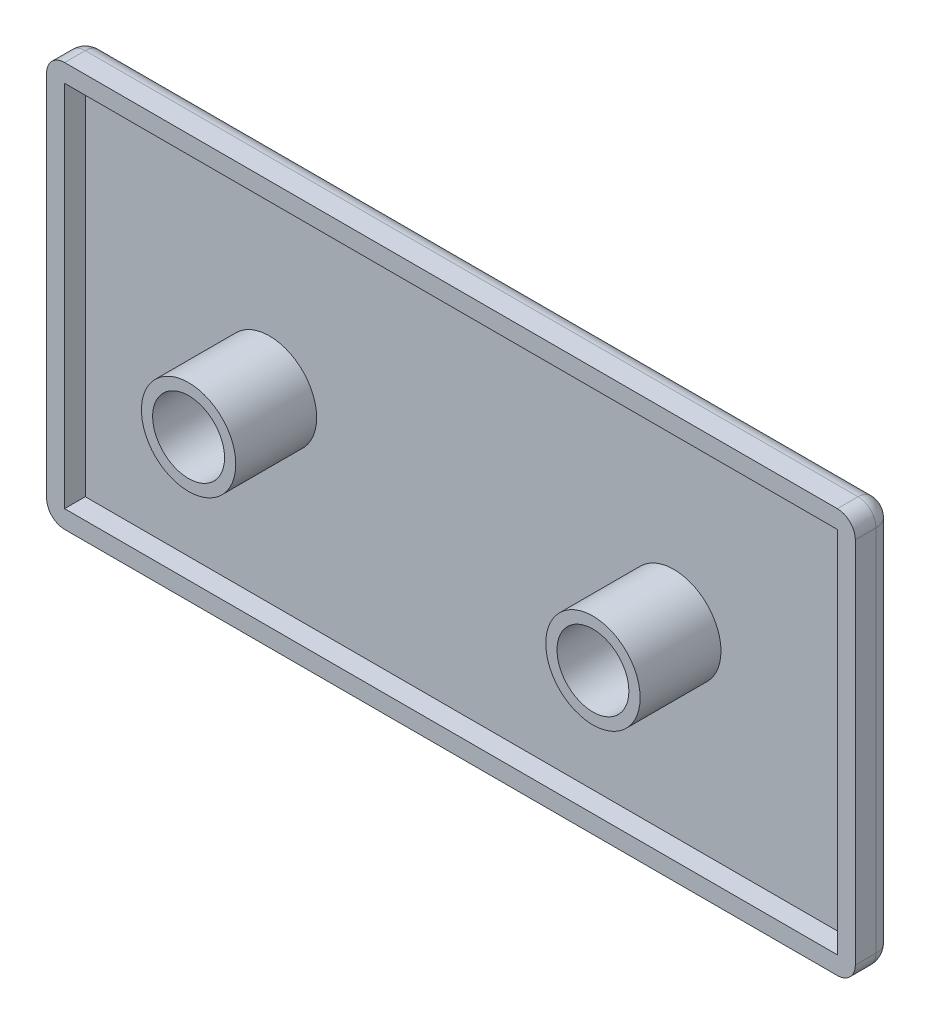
ISO-10303-21;
HEADER;
FILE_DESCRIPTION(('STEP AP214'),'2;1');
FILE_NAME('part.step','',(''),(''),'','','');
FILE_SCHEMA(('AUTOMOTIVE_DESIGN { 1 0 10303 214 1 1 1 1 }'));
ENDSEC;
DATA;
#1=APPLICATION_CONTEXT('core data for automotive mechanical design processes');
#2=APPLICATION_PROTOCOL_DEFINITION('international standard','automotive_design',2000,#1);
#3=PRODUCT_CONTEXT('',#1,'mechanical');
#4=PRODUCT('Part','Part','',(#3));
#5=PRODUCT_RELATED_PRODUCT_CATEGORY('part','',(#4));
#6=PRODUCT_DEFINITION_FORMATION('','',#4);
#7=PRODUCT_DEFINITION_CONTEXT('part definition',#1,'design');
#8=PRODUCT_DEFINITION('design','',#6,#7);
#9=PRODUCT_DEFINITION_SHAPE('','',#8);
#10=(LENGTH_UNIT() NAMED_UNIT(*) SI_UNIT(.MILLI.,.METRE.));
#11=(NAMED_UNIT(*) PLANE_ANGLE_UNIT() SI_UNIT($,.RADIAN.));
#12=(NAMED_UNIT(*) SI_UNIT($,.STERADIAN.) SOLID_ANGLE_UNIT());
#13=UNCERTAINTY_MEASURE_WITH_UNIT(LENGTH_MEASURE(1.E-05),#10,'distance_accuracy_value','');
#14=(GEOMETRIC_REPRESENTATION_CONTEXT(3) GLOBAL_UNCERTAINTY_ASSIGNED_CONTEXT((#13)) GLOBAL_UNIT_ASSIGNED_CONTEXT((#10,
#11,#12)) REPRESENTATION_CONTEXT('',''));
#15=CARTESIAN_POINT('',(0.,0.,0.));
#16=DIRECTION('',(0.,0.,1.));
#17=DIRECTION('',(1.,0.,0.));
#18=AXIS2_PLACEMENT_3D('',#15,#16,#17);
#19=CARTESIAN_POINT('',(0.,0.,-0.15));
#20=DIRECTION('',(0.,0.,1.));
#21=DIRECTION('',(1.,0.,0.));
#22=AXIS2_PLACEMENT_3D('',#19,#20,#21);
#23=PLANE('',#22);
#24=DIRECTION('',(1.,0.,0.));
#25=VECTOR('',#24,1.);
#26=CARTESIAN_POINT('',(-45.,-20.5,-0.15));
#27=LINE('',#26,#25);
#28=CARTESIAN_POINT('',(-43.,-20.5,-0.15));
#29=VERTEX_POINT('',#28);
#30=CARTESIAN_POINT('',(43.,-20.5,-0.15));
#31=VERTEX_POINT('',#30);
#32=EDGE_CURVE('E134',#29,#31,#27,.T.);
#33=ORIENTED_EDGE('',*,*,#32,.T.);
#34=DIRECTION('',(0.,-1.,0.));
#35=VECTOR('',#34,1.);
#36=CARTESIAN_POINT('',(43.,0.,-0.15));
#37=LINE('',#36,#35);
#38=CARTESIAN_POINT('',(43.,20.5,-0.15));
#39=VERTEX_POINT('',#38);
#40=EDGE_CURVE('E166',#39,#31,#37,.T.);
#41=ORIENTED_EDGE('',*,*,#40,.F.);
#42=DIRECTION('',(1.,0.,0.));
#43=VECTOR('',#42,1.);
#44=CARTESIAN_POINT('',(0.,20.5,-0.15));
#45=LINE('',#44,#43);
#46=CARTESIAN_POINT('',(-43.,20.5,-0.15));
#47=VERTEX_POINT('',#46);
#48=EDGE_CURVE('E144',#47,#39,#45,.T.);
#49=ORIENTED_EDGE('',*,*,#48,.F.);
#50=DIRECTION('',(0.,-1.,0.));
#51=VECTOR('',#50,1.);
#52=CARTESIAN_POINT('',(-43.,22.5,-0.15));
#53=LINE('',#52,#51);
#54=EDGE_CURVE('E147',#47,#29,#53,.T.);
#55=ORIENTED_EDGE('',*,*,#54,.T.);
#56=EDGE_LOOP('',(#33,#41,#49,#55));
#57=FACE_BOUND('',#56,.T.);
#58=CARTESIAN_POINT('',(-22.5,0.,-0.15));
#59=DIRECTION('',(0.,0.,1.));
#60=DIRECTION('',(1.,0.,0.));
#61=AXIS2_PLACEMENT_3D('',#58,#59,#60);
#62=CIRCLE('',#61,5.25);
#63=CARTESIAN_POINT('',(-17.25,0.,-0.15));
#64=VERTEX_POINT('',#63);
#65=EDGE_CURVE('E601',#64,#64,#62,.T.);
#66=ORIENTED_EDGE('',*,*,#65,.F.);
#67=EDGE_LOOP('',(#66));
#68=FACE_BOUND('',#67,.T.);
#69=CARTESIAN_POINT('',(22.5,0.,-0.15));
#70=DIRECTION('',(0.,0.,1.));
#71=DIRECTION('',(1.,0.,0.));
#72=AXIS2_PLACEMENT_3D('',#69,#70,#71);
#73=CIRCLE('',#72,5.25);
#74=CARTESIAN_POINT('',(27.75,0.,-0.15));
#75=VERTEX_POINT('',#74);
#76=EDGE_CURVE('E610',#75,#75,#73,.T.);
#77=ORIENTED_EDGE('',*,*,#76,.F.);
#78=EDGE_LOOP('',(#77));
#79=FACE_BOUND('',#78,.T.);
#80=ADVANCED_FACE('F33',(#57,#68,#79),#23,.T.);
#81=CARTESIAN_POINT('',(-45.,22.5,2.15));
#82=DIRECTION('',(1.,0.,0.));
#83=DIRECTION('',(0.,1.,0.));
#84=AXIS2_PLACEMENT_3D('',#81,#82,#83);
#85=PLANE('',#84);
#86=DIRECTION('',(0.,-1.,0.));
#87=VECTOR('',#86,1.);
#88=CARTESIAN_POINT('',(-45.,22.5,2.15));
#89=LINE('',#88,#87);
#90=CARTESIAN_POINT('',(-45.,20.5,2.15));
#91=VERTEX_POINT('',#90);
#92=CARTESIAN_POINT('',(-45.,-20.5,2.15));
#93=VERTEX_POINT('',#92);
#94=EDGE_CURVE('E175',#91,#93,#89,.T.);
#95=ORIENTED_EDGE('',*,*,#94,.F.);
#96=DIRECTION('',(0.,0.,-1.));
#97=VECTOR('',#96,1.);
#98=CARTESIAN_POINT('',(-45.,20.5,2.15));
#99=LINE('',#98,#97);
#100=CARTESIAN_POINT('',(-45.,20.5,-0.15));
#101=VERTEX_POINT('',#100);
#102=EDGE_CURVE('E192',#91,#101,#99,.T.);
#103=ORIENTED_EDGE('',*,*,#102,.T.);
#104=DIRECTION('',(0.,-1.,0.));
#105=VECTOR('',#104,1.);
#106=CARTESIAN_POINT('',(-45.,22.5,-0.15));
#107=LINE('',#106,#105);
#108=CARTESIAN_POINT('',(-45.,-20.5,-0.15));
#109=VERTEX_POINT('',#108);
#110=EDGE_CURVE('E190',#101,#109,#107,.T.);
#111=ORIENTED_EDGE('',*,*,#110,.T.);
#112=DIRECTION('',(0.,0.,-1.));
#113=VECTOR('',#112,1.);
#114=CARTESIAN_POINT('',(-45.,-20.5,2.15));
#115=LINE('',#114,#113);
#116=EDGE_CURVE('E188',#109,#93,#115,.F.);
#117=ORIENTED_EDGE('',*,*,#116,.T.);
#118=EDGE_LOOP('',(#95,#103,#111,#117));
#119=FACE_BOUND('',#118,.T.);
#120=ADVANCED_FACE('F283',(#119),#85,.F.);
#121=CARTESIAN_POINT('',(-45.,-22.5,2.15));
#122=DIRECTION('',(0.,1.,0.));
#123=DIRECTION('',(0.,0.,1.));
#124=AXIS2_PLACEMENT_3D('',#121,#122,#123);
#125=PLANE('',#124);
#126=DIRECTION('',(1.,0.,0.));
#127=VECTOR('',#126,1.);
#128=CARTESIAN_POINT('',(-45.,-22.5,2.15));
#129=LINE('',#128,#127);
#130=CARTESIAN_POINT('',(-43.,-22.5,2.15));
#131=VERTEX_POINT('',#130);
#132=CARTESIAN_POINT('',(43.,-22.5,2.15));
#133=VERTEX_POINT('',#132);
#134=EDGE_CURVE('E178',#131,#133,#129,.T.);
#135=ORIENTED_EDGE('',*,*,#134,.F.);
#136=DIRECTION('',(0.,0.,-1.));
#137=VECTOR('',#136,1.);
#138=CARTESIAN_POINT('',(-43.,-22.5,2.15));
#139=LINE('',#138,#137);
#140=CARTESIAN_POINT('',(-43.,-22.5,-0.15));
#141=VERTEX_POINT('',#140);
#142=EDGE_CURVE('E222',#131,#141,#139,.T.);
#143=ORIENTED_EDGE('',*,*,#142,.T.);
#144=DIRECTION('',(1.,0.,0.));
#145=VECTOR('',#144,1.);
#146=CARTESIAN_POINT('',(-45.,-22.5,-0.15));
#147=LINE('',#146,#145);
#148=CARTESIAN_POINT('',(43.,-22.5,-0.15));
#149=VERTEX_POINT('',#148);
#150=EDGE_CURVE('E220',#141,#149,#147,.T.);
#151=ORIENTED_EDGE('',*,*,#150,.T.);
#152=DIRECTION('',(0.,0.,-1.));
#153=VECTOR('',#152,1.);
#154=CARTESIAN_POINT('',(43.,-22.5,2.15));
#155=LINE('',#154,#153);
#156=EDGE_CURVE('E218',#149,#133,#155,.F.);
#157=ORIENTED_EDGE('',*,*,#156,.T.);
#158=EDGE_LOOP('',(#135,#143,#151,#157));
#159=FACE_BOUND('',#158,.T.);
#160=ADVANCED_FACE('F350',(#159),#125,.F.);
#161=CARTESIAN_POINT('',(45.,22.5,2.15));
#162=DIRECTION('',(-1.,0.,0.));
#163=DIRECTION('',(0.,-1.,0.));
#164=AXIS2_PLACEMENT_3D('',#161,#162,#163);
#165=PLANE('',#164);
#166=DIRECTION('',(0.,1.,0.));
#167=VECTOR('',#166,1.);
#168=CARTESIAN_POINT('',(45.,22.5,2.15));
#169=LINE('',#168,#167);
#170=CARTESIAN_POINT('',(45.,-20.5,2.15));
#171=VERTEX_POINT('',#170);
#172=CARTESIAN_POINT('',(45.,20.5,2.15));
#173=VERTEX_POINT('',#172);
#174=EDGE_CURVE('E182',#171,#173,#169,.T.);
#175=ORIENTED_EDGE('',*,*,#174,.F.);
#176=DIRECTION('',(0.,0.,-1.));
#177=VECTOR('',#176,1.);
#178=CARTESIAN_POINT('',(45.,-20.5,2.15));
#179=LINE('',#178,#177);
#180=CARTESIAN_POINT('',(45.,-20.5,-0.15));
#181=VERTEX_POINT('',#180);
#182=EDGE_CURVE('E56',#171,#181,#179,.T.);
#183=ORIENTED_EDGE('',*,*,#182,.T.);
#184=DIRECTION('',(0.,1.,0.));
#185=VECTOR('',#184,1.);
#186=CARTESIAN_POINT('',(45.,22.5,-0.15));
#187=LINE('',#186,#185);
#188=CARTESIAN_POINT('',(45.,20.5,-0.15));
#189=VERTEX_POINT('',#188);
#190=EDGE_CURVE('E226',#181,#189,#187,.T.);
#191=ORIENTED_EDGE('',*,*,#190,.T.);
#192=DIRECTION('',(0.,0.,-1.));
#193=VECTOR('',#192,1.);
#194=CARTESIAN_POINT('',(45.,20.5,2.15));
#195=LINE('',#194,#193);
#196=EDGE_CURVE('E224',#189,#173,#195,.F.);
#197=ORIENTED_EDGE('',*,*,#196,.T.);
#198=EDGE_LOOP('',(#175,#183,#191,#197));
#199=FACE_BOUND('',#198,.T.);
#200=ADVANCED_FACE('F364',(#199),#165,.F.);
#201=CARTESIAN_POINT('',(-45.,22.5,2.15));
#202=DIRECTION('',(0.,-1.,0.));
#203=DIRECTION('',(0.,0.,-1.));
#204=AXIS2_PLACEMENT_3D('',#201,#202,#203);
#205=PLANE('',#204);
#206=DIRECTION('',(-1.,0.,0.));
#207=VECTOR('',#206,1.);
#208=CARTESIAN_POINT('',(-45.,22.5,-0.15));
#209=LINE('',#208,#207);
#210=CARTESIAN_POINT('',(43.,22.5,-0.15));
#211=VERTEX_POINT('',#210);
#212=CARTESIAN_POINT('',(-43.,22.5,-0.15));
#213=VERTEX_POINT('',#212);
#214=EDGE_CURVE('E197',#211,#213,#209,.T.);
#215=ORIENTED_EDGE('',*,*,#214,.T.);
#216=DIRECTION('',(0.,0.,-1.));
#217=VECTOR('',#216,1.);
#218=CARTESIAN_POINT('',(-43.,22.5,2.15));
#219=LINE('',#218,#217);
#220=CARTESIAN_POINT('',(-43.,22.5,2.15));
#221=VERTEX_POINT('',#220);
#222=EDGE_CURVE('E199',#213,#221,#219,.F.);
#223=ORIENTED_EDGE('',*,*,#222,.T.);
#224=DIRECTION('',(-1.,0.,0.));
#225=VECTOR('',#224,1.);
#226=CARTESIAN_POINT('',(-45.,22.5,2.15));
#227=LINE('',#226,#225);
#228=CARTESIAN_POINT('',(43.,22.5,2.15));
#229=VERTEX_POINT('',#228);
#230=EDGE_CURVE('E185',#229,#221,#227,.T.);
#231=ORIENTED_EDGE('',*,*,#230,.F.);
#232=DIRECTION('',(0.,0.,-1.));
#233=VECTOR('',#232,1.);
#234=CARTESIAN_POINT('',(43.,22.5,2.15));
#235=LINE('',#234,#233);
#236=EDGE_CURVE('E195',#229,#211,#235,.T.);
#237=ORIENTED_EDGE('',*,*,#236,.T.);
#238=EDGE_LOOP('',(#215,#223,#231,#237));
#239=FACE_BOUND('',#238,.T.);
#240=ADVANCED_FACE('F328',(#239),#205,.F.);
#241=CARTESIAN_POINT('',(0.,0.,2.15));
#242=DIRECTION('',(0.,0.,1.));
#243=DIRECTION('',(1.,0.,0.));
#244=AXIS2_PLACEMENT_3D('',#241,#242,#243);
#245=PLANE('',#244);
#246=DIRECTION('',(-1.,0.,0.));
#247=VECTOR('',#246,1.);
#248=CARTESIAN_POINT('',(-45.,20.5,2.15));
#249=LINE('',#248,#247);
#250=CARTESIAN_POINT('',(43.,20.5,2.15));
#251=VERTEX_POINT('',#250);
#252=CARTESIAN_POINT('',(-43.,20.5,2.15));
#253=VERTEX_POINT('',#252);
#254=EDGE_CURVE('E157',#251,#253,#249,.T.);
#255=ORIENTED_EDGE('',*,*,#254,.F.);
#256=DIRECTION('',(0.,1.,0.));
#257=VECTOR('',#256,1.);
#258=CARTESIAN_POINT('',(43.,22.5,2.15));
#259=LINE('',#258,#257);
#260=CARTESIAN_POINT('',(43.,-20.5,2.15));
#261=VERTEX_POINT('',#260);
#262=EDGE_CURVE('E160',#261,#251,#259,.T.);
#263=ORIENTED_EDGE('',*,*,#262,.F.);
#264=DIRECTION('',(1.,0.,0.));
#265=VECTOR('',#264,1.);
#266=CARTESIAN_POINT('',(-45.,-20.5,2.15));
#267=LINE('',#266,#265);
#268=CARTESIAN_POINT('',(-43.,-20.5,2.15));
#269=VERTEX_POINT('',#268);
#270=EDGE_CURVE('E48',#269,#261,#267,.T.);
#271=ORIENTED_EDGE('',*,*,#270,.F.);
#272=DIRECTION('',(0.,-1.,0.));
#273=VECTOR('',#272,1.);
#274=CARTESIAN_POINT('',(-43.,22.5,2.15));
#275=LINE('',#274,#273);
#276=EDGE_CURVE('E156',#253,#269,#275,.T.);
#277=ORIENTED_EDGE('',*,*,#276,.F.);
#278=EDGE_LOOP('',(#255,#263,#271,#277));
#279=FACE_BOUND('',#278,.T.);
#280=ORIENTED_EDGE('',*,*,#230,.T.);
#281=CARTESIAN_POINT('',(-43.,20.5,2.15));
#282=DIRECTION('',(0.,0.,1.));
#283=DIRECTION('',(1.,0.,0.));
#284=AXIS2_PLACEMENT_3D('',#281,#282,#283);
#285=CIRCLE('',#284,2.);
#286=EDGE_CURVE('E207',#221,#91,#285,.T.);
#287=ORIENTED_EDGE('',*,*,#286,.T.);
#288=ORIENTED_EDGE('',*,*,#94,.T.);
#289=CARTESIAN_POINT('',(-43.,-20.5,2.15));
#290=DIRECTION('',(0.,0.,1.));
#291=DIRECTION('',(1.,0.,0.));
#292=AXIS2_PLACEMENT_3D('',#289,#290,#291);
#293=CIRCLE('',#292,2.);
#294=EDGE_CURVE('E205',#93,#131,#293,.T.);
#295=ORIENTED_EDGE('',*,*,#294,.T.);
#296=ORIENTED_EDGE('',*,*,#134,.T.);
#297=CARTESIAN_POINT('',(43.,-20.5,2.15));
#298=DIRECTION('',(0.,0.,1.));
#299=DIRECTION('',(1.,0.,0.));
#300=AXIS2_PLACEMENT_3D('',#297,#298,#299);
#301=CIRCLE('',#300,2.);
#302=EDGE_CURVE('E203',#133,#171,#301,.T.);
#303=ORIENTED_EDGE('',*,*,#302,.T.);
#304=ORIENTED_EDGE('',*,*,#174,.T.);
#305=CARTESIAN_POINT('',(43.,20.5,2.15));
#306=DIRECTION('',(0.,0.,1.));
#307=DIRECTION('',(1.,0.,0.));
#308=AXIS2_PLACEMENT_3D('',#305,#306,#307);
#309=CIRCLE('',#308,2.);
#310=EDGE_CURVE('E201',#173,#229,#309,.T.);
#311=ORIENTED_EDGE('',*,*,#310,.T.);
#312=EDGE_LOOP('',(#280,#287,#288,#295,#296,#303,#304,#311));
#313=FACE_BOUND('',#312,.T.);
#314=ADVANCED_FACE('F324',(#279,#313),#245,.T.);
#315=CARTESIAN_POINT('',(0.,0.,-2.15));
#316=DIRECTION('',(0.,0.,1.));
#317=DIRECTION('',(1.,0.,0.));
#318=AXIS2_PLACEMENT_3D('',#315,#316,#317);
#319=PLANE('',#318);
#320=DIRECTION('',(1.,0.,0.));
#321=VECTOR('',#320,1.);
#322=CARTESIAN_POINT('',(0.,-20.5,-2.15));
#323=LINE('',#322,#321);
#324=CARTESIAN_POINT('',(43.,-20.5,-2.15));
#325=VERTEX_POINT('',#324);
#326=CARTESIAN_POINT('',(-43.,-20.5,-2.15));
#327=VERTEX_POINT('',#326);
#328=EDGE_CURVE('E213',#325,#327,#323,.F.);
#329=ORIENTED_EDGE('',*,*,#328,.T.);
#330=DIRECTION('',(0.,-1.,0.));
#331=VECTOR('',#330,1.);
#332=CARTESIAN_POINT('',(-43.,0.,-2.15));
#333=LINE('',#332,#331);
#334=CARTESIAN_POINT('',(-43.,20.5,-2.15));
#335=VERTEX_POINT('',#334);
#336=EDGE_CURVE('E215',#327,#335,#333,.F.);
#337=ORIENTED_EDGE('',*,*,#336,.T.);
#338=DIRECTION('',(-1.,0.,0.));
#339=VECTOR('',#338,1.);
#340=CARTESIAN_POINT('',(0.,20.5,-2.15));
#341=LINE('',#340,#339);
#342=CARTESIAN_POINT('',(43.,20.5,-2.15));
#343=VERTEX_POINT('',#342);
#344=EDGE_CURVE('E211',#335,#343,#341,.F.);
#345=ORIENTED_EDGE('',*,*,#344,.T.);
#346=DIRECTION('',(0.,1.,0.));
#347=VECTOR('',#346,1.);
#348=CARTESIAN_POINT('',(43.,0.,-2.15));
#349=LINE('',#348,#347);
#350=EDGE_CURVE('E209',#343,#325,#349,.F.);
#351=ORIENTED_EDGE('',*,*,#350,.T.);
#352=EDGE_LOOP('',(#329,#337,#345,#351));
#353=FACE_BOUND('',#352,.T.);
#354=ADVANCED_FACE('F327',(#353),#319,.F.);
#355=CARTESIAN_POINT('',(43.,-20.5,2.15));
#356=DIRECTION('',(0.,0.,-1.));
#357=DIRECTION('',(-1.,0.,0.));
#358=AXIS2_PLACEMENT_3D('',#355,#356,#357);
#359=CYLINDRICAL_SURFACE('',#358,2.);
#360=CARTESIAN_POINT('',(43.,-20.5,-0.15));
#361=DIRECTION('',(0.,0.,-1.));
#362=DIRECTION('',(-1.,0.,0.));
#363=AXIS2_PLACEMENT_3D('',#360,#361,#362);
#364=CIRCLE('',#363,2.);
#365=EDGE_CURVE('E179',#181,#149,#364,.T.);
#366=ORIENTED_EDGE('',*,*,#365,.F.);
#367=ORIENTED_EDGE('',*,*,#182,.F.);
#368=ORIENTED_EDGE('',*,*,#302,.F.);
#369=ORIENTED_EDGE('',*,*,#156,.F.);
#370=EDGE_LOOP('',(#366,#367,#368,#369));
#371=FACE_BOUND('',#370,.T.);
#372=ADVANCED_FACE('F35',(#371),#359,.T.);
#373=CARTESIAN_POINT('',(43.,-20.5,-0.15));
#374=DIRECTION('',(0.,0.,1.));
#375=DIRECTION('',(1.,0.,0.));
#376=AXIS2_PLACEMENT_3D('',#373,#374,#375);
#377=SPHERICAL_SURFACE('',#376,2.);
#378=CARTESIAN_POINT('',(43.,-20.5,-0.15));
#379=DIRECTION('',(0.,-1.,0.));
#380=DIRECTION('',(0.,0.,-1.));
#381=AXIS2_PLACEMENT_3D('',#378,#379,#380);
#382=CIRCLE('',#381,2.);
#383=EDGE_CURVE('E253',#181,#325,#382,.F.);
#384=ORIENTED_EDGE('',*,*,#383,.F.);
#385=ORIENTED_EDGE('',*,*,#365,.T.);
#386=CARTESIAN_POINT('',(43.,-20.5,-0.15));
#387=DIRECTION('',(1.,0.,0.));
#388=DIRECTION('',(0.,0.,-1.));
#389=AXIS2_PLACEMENT_3D('',#386,#387,#388);
#390=CIRCLE('',#389,2.);
#391=EDGE_CURVE('E256',#325,#149,#390,.F.);
#392=ORIENTED_EDGE('',*,*,#391,.F.);
#393=EDGE_LOOP('',(#384,#385,#392));
#394=FACE_BOUND('',#393,.T.);
#395=ADVANCED_FACE('F360',(#394),#377,.T.);
#396=CARTESIAN_POINT('',(-43.,-20.5,2.15));
#397=DIRECTION('',(0.,0.,-1.));
#398=DIRECTION('',(-1.,0.,0.));
#399=AXIS2_PLACEMENT_3D('',#396,#397,#398);
#400=CYLINDRICAL_SURFACE('',#399,2.);
#401=ORIENTED_EDGE('',*,*,#294,.F.);
#402=ORIENTED_EDGE('',*,*,#116,.F.);
#403=CARTESIAN_POINT('',(-43.,-20.5,-0.15));
#404=DIRECTION('',(0.,0.,-1.));
#405=DIRECTION('',(-1.,0.,0.));
#406=AXIS2_PLACEMENT_3D('',#403,#404,#405);
#407=CIRCLE('',#406,2.);
#408=EDGE_CURVE('E250',#141,#109,#407,.T.);
#409=ORIENTED_EDGE('',*,*,#408,.F.);
#410=ORIENTED_EDGE('',*,*,#142,.F.);
#411=EDGE_LOOP('',(#401,#402,#409,#410));
#412=FACE_BOUND('',#411,.T.);
#413=ADVANCED_FACE('F346',(#412),#400,.T.);
#414=CARTESIAN_POINT('',(-45.,-20.5,-0.15));
#415=DIRECTION('',(1.,0.,0.));
#416=DIRECTION('',(0.,0.,-1.));
#417=AXIS2_PLACEMENT_3D('',#414,#415,#416);
#418=CYLINDRICAL_SURFACE('',#417,2.);
#419=ORIENTED_EDGE('',*,*,#391,.T.);
#420=ORIENTED_EDGE('',*,*,#150,.F.);
#421=CARTESIAN_POINT('',(-43.,-20.5,-0.15));
#422=DIRECTION('',(-1.,0.,0.));
#423=DIRECTION('',(0.,0.,1.));
#424=AXIS2_PLACEMENT_3D('',#421,#422,#423);
#425=CIRCLE('',#424,2.);
#426=EDGE_CURVE('E247',#327,#141,#425,.T.);
#427=ORIENTED_EDGE('',*,*,#426,.F.);
#428=ORIENTED_EDGE('',*,*,#328,.F.);
#429=EDGE_LOOP('',(#419,#420,#427,#428));
#430=FACE_BOUND('',#429,.T.);
#431=ADVANCED_FACE('F354',(#430),#418,.T.);
#432=CARTESIAN_POINT('',(43.,22.5,-0.15));
#433=DIRECTION('',(0.,1.,0.));
#434=DIRECTION('',(-1.,0.,0.));
#435=AXIS2_PLACEMENT_3D('',#432,#433,#434);
#436=CYLINDRICAL_SURFACE('',#435,2.);
#437=ORIENTED_EDGE('',*,*,#383,.T.);
#438=ORIENTED_EDGE('',*,*,#350,.F.);
#439=CARTESIAN_POINT('',(43.,20.5,-0.15));
#440=DIRECTION('',(0.,1.,0.));
#441=DIRECTION('',(0.,0.,1.));
#442=AXIS2_PLACEMENT_3D('',#439,#440,#441);
#443=CIRCLE('',#442,2.);
#444=EDGE_CURVE('E244',#189,#343,#443,.T.);
#445=ORIENTED_EDGE('',*,*,#444,.F.);
#446=ORIENTED_EDGE('',*,*,#190,.F.);
#447=EDGE_LOOP('',(#437,#438,#445,#446));
#448=FACE_BOUND('',#447,.T.);
#449=ADVANCED_FACE('F373',(#448),#436,.T.);
#450=CARTESIAN_POINT('',(43.,20.5,2.15));
#451=DIRECTION('',(0.,0.,-1.));
#452=DIRECTION('',(-1.,0.,0.));
#453=AXIS2_PLACEMENT_3D('',#450,#451,#452);
#454=CYLINDRICAL_SURFACE('',#453,2.);
#455=ORIENTED_EDGE('',*,*,#310,.F.);
#456=ORIENTED_EDGE('',*,*,#196,.F.);
#457=CARTESIAN_POINT('',(43.,20.5,-0.15));
#458=DIRECTION('',(0.,0.,-1.));
#459=DIRECTION('',(-1.,0.,0.));
#460=AXIS2_PLACEMENT_3D('',#457,#458,#459);
#461=CIRCLE('',#460,2.);
#462=EDGE_CURVE('E241',#211,#189,#461,.T.);
#463=ORIENTED_EDGE('',*,*,#462,.F.);
#464=ORIENTED_EDGE('',*,*,#236,.F.);
#465=EDGE_LOOP('',(#455,#456,#463,#464));
#466=FACE_BOUND('',#465,.T.);
#467=ADVANCED_FACE('F369',(#466),#454,.T.);
#468=CARTESIAN_POINT('',(-43.,-20.5,-0.15));
#469=DIRECTION('',(0.,0.,1.));
#470=DIRECTION('',(1.,0.,0.));
#471=AXIS2_PLACEMENT_3D('',#468,#469,#470);
#472=SPHERICAL_SURFACE('',#471,2.);
#473=ORIENTED_EDGE('',*,*,#426,.T.);
#474=ORIENTED_EDGE('',*,*,#408,.T.);
#475=CARTESIAN_POINT('',(-43.,-20.5,-0.15));
#476=DIRECTION('',(0.,-1.,0.));
#477=DIRECTION('',(0.,0.,-1.));
#478=AXIS2_PLACEMENT_3D('',#475,#476,#477);
#479=CIRCLE('',#478,2.);
#480=EDGE_CURVE('E238',#327,#109,#479,.F.);
#481=ORIENTED_EDGE('',*,*,#480,.F.);
#482=EDGE_LOOP('',(#473,#474,#481));
#483=FACE_BOUND('',#482,.T.);
#484=ADVANCED_FACE('F407',(#483),#472,.T.);
#485=CARTESIAN_POINT('',(43.,20.5,-0.15));
#486=DIRECTION('',(0.,0.,1.));
#487=DIRECTION('',(1.,0.,0.));
#488=AXIS2_PLACEMENT_3D('',#485,#486,#487);
#489=SPHERICAL_SURFACE('',#488,2.);
#490=ORIENTED_EDGE('',*,*,#462,.T.);
#491=ORIENTED_EDGE('',*,*,#444,.T.);
#492=CARTESIAN_POINT('',(43.,20.5,-0.15));
#493=DIRECTION('',(1.,0.,0.));
#494=DIRECTION('',(0.,0.,-1.));
#495=AXIS2_PLACEMENT_3D('',#492,#493,#494);
#496=CIRCLE('',#495,2.);
#497=EDGE_CURVE('E235',#211,#343,#496,.F.);
#498=ORIENTED_EDGE('',*,*,#497,.F.);
#499=EDGE_LOOP('',(#490,#491,#498));
#500=FACE_BOUND('',#499,.T.);
#501=ADVANCED_FACE('F375',(#500),#489,.T.);
#502=CARTESIAN_POINT('',(-43.,22.5,-0.15));
#503=DIRECTION('',(0.,-1.,0.));
#504=DIRECTION('',(1.,0.,0.));
#505=AXIS2_PLACEMENT_3D('',#502,#503,#504);
#506=CYLINDRICAL_SURFACE('',#505,2.);
#507=ORIENTED_EDGE('',*,*,#480,.T.);
#508=ORIENTED_EDGE('',*,*,#110,.F.);
#509=CARTESIAN_POINT('',(-43.,20.5,-0.15));
#510=DIRECTION('',(0.,1.,0.));
#511=DIRECTION('',(0.,0.,1.));
#512=AXIS2_PLACEMENT_3D('',#509,#510,#511);
#513=CIRCLE('',#512,2.);
#514=EDGE_CURVE('E232',#335,#101,#513,.T.);
#515=ORIENTED_EDGE('',*,*,#514,.F.);
#516=ORIENTED_EDGE('',*,*,#336,.F.);
#517=EDGE_LOOP('',(#507,#508,#515,#516));
#518=FACE_BOUND('',#517,.T.);
#519=ADVANCED_FACE('F401',(#518),#506,.T.);
#520=CARTESIAN_POINT('',(-45.,20.5,-0.15));
#521=DIRECTION('',(-1.,0.,0.));
#522=DIRECTION('',(0.,0.,1.));
#523=AXIS2_PLACEMENT_3D('',#520,#521,#522);
#524=CYLINDRICAL_SURFACE('',#523,2.);
#525=ORIENTED_EDGE('',*,*,#497,.T.);
#526=ORIENTED_EDGE('',*,*,#344,.F.);
#527=CARTESIAN_POINT('',(-43.,20.5,-0.15));
#528=DIRECTION('',(-1.,0.,0.));
#529=DIRECTION('',(0.,0.,1.));
#530=AXIS2_PLACEMENT_3D('',#527,#528,#529);
#531=CIRCLE('',#530,2.);
#532=EDGE_CURVE('E230',#213,#335,#531,.T.);
#533=ORIENTED_EDGE('',*,*,#532,.F.);
#534=ORIENTED_EDGE('',*,*,#214,.F.);
#535=EDGE_LOOP('',(#525,#526,#533,#534));
#536=FACE_BOUND('',#535,.T.);
#537=ADVANCED_FACE('F380',(#536),#524,.T.);
#538=CARTESIAN_POINT('',(-43.,20.5,-0.15));
#539=DIRECTION('',(0.,0.,1.));
#540=DIRECTION('',(1.,0.,0.));
#541=AXIS2_PLACEMENT_3D('',#538,#539,#540);
#542=SPHERICAL_SURFACE('',#541,2.);
#543=ORIENTED_EDGE('',*,*,#532,.T.);
#544=ORIENTED_EDGE('',*,*,#514,.T.);
#545=CARTESIAN_POINT('',(-43.,20.5,-0.15));
#546=DIRECTION('',(0.,0.,-1.));
#547=DIRECTION('',(-1.,0.,0.));
#548=AXIS2_PLACEMENT_3D('',#545,#546,#547);
#549=CIRCLE('',#548,2.);
#550=EDGE_CURVE('E165',#213,#101,#549,.F.);
#551=ORIENTED_EDGE('',*,*,#550,.F.);
#552=EDGE_LOOP('',(#543,#544,#551));
#553=FACE_BOUND('',#552,.T.);
#554=ADVANCED_FACE('F395',(#553),#542,.T.);
#555=CARTESIAN_POINT('',(-43.,20.5,2.15));
#556=DIRECTION('',(0.,0.,-1.));
#557=DIRECTION('',(-1.,0.,0.));
#558=AXIS2_PLACEMENT_3D('',#555,#556,#557);
#559=CYLINDRICAL_SURFACE('',#558,2.);
#560=ORIENTED_EDGE('',*,*,#286,.F.);
#561=ORIENTED_EDGE('',*,*,#222,.F.);
#562=ORIENTED_EDGE('',*,*,#550,.T.);
#563=ORIENTED_EDGE('',*,*,#102,.F.);
#564=EDGE_LOOP('',(#560,#561,#562,#563));
#565=FACE_BOUND('',#564,.T.);
#566=ADVANCED_FACE('F311',(#565),#559,.T.);
#567=CARTESIAN_POINT('',(-43.,22.5,2.15));
#568=DIRECTION('',(1.,0.,0.));
#569=DIRECTION('',(0.,1.,0.));
#570=AXIS2_PLACEMENT_3D('',#567,#568,#569);
#571=PLANE('',#570);
#572=ORIENTED_EDGE('',*,*,#276,.T.);
#573=DIRECTION('',(0.,0.,1.));
#574=VECTOR('',#573,1.);
#575=CARTESIAN_POINT('',(-43.,-20.5,2.15));
#576=LINE('',#575,#574);
#577=EDGE_CURVE('E138',#29,#269,#576,.T.);
#578=ORIENTED_EDGE('',*,*,#577,.F.);
#579=ORIENTED_EDGE('',*,*,#54,.F.);
#580=DIRECTION('',(0.,0.,1.));
#581=VECTOR('',#580,1.);
#582=CARTESIAN_POINT('',(-43.,20.5,2.15));
#583=LINE('',#582,#581);
#584=EDGE_CURVE('E152',#47,#253,#583,.T.);
#585=ORIENTED_EDGE('',*,*,#584,.T.);
#586=EDGE_LOOP('',(#572,#578,#579,#585));
#587=FACE_BOUND('',#586,.T.);
#588=ADVANCED_FACE('F154',(#587),#571,.T.);
#589=CARTESIAN_POINT('',(-45.,-20.5,2.15));
#590=DIRECTION('',(0.,1.,0.));
#591=DIRECTION('',(0.,0.,1.));
#592=AXIS2_PLACEMENT_3D('',#589,#590,#591);
#593=PLANE('',#592);
#594=ORIENTED_EDGE('',*,*,#270,.T.);
#595=DIRECTION('',(0.,0.,-1.));
#596=VECTOR('',#595,1.);
#597=CARTESIAN_POINT('',(43.,-20.5,2.15));
#598=LINE('',#597,#596);
#599=EDGE_CURVE('E140',#261,#31,#598,.T.);
#600=ORIENTED_EDGE('',*,*,#599,.T.);
#601=ORIENTED_EDGE('',*,*,#32,.F.);
#602=ORIENTED_EDGE('',*,*,#577,.T.);
#603=EDGE_LOOP('',(#594,#600,#601,#602));
#604=FACE_BOUND('',#603,.T.);
#605=ADVANCED_FACE('F136',(#604),#593,.T.);
#606=CARTESIAN_POINT('',(43.,22.5,2.15));
#607=DIRECTION('',(-1.,0.,0.));
#608=DIRECTION('',(0.,-1.,0.));
#609=AXIS2_PLACEMENT_3D('',#606,#607,#608);
#610=PLANE('',#609);
#611=ORIENTED_EDGE('',*,*,#262,.T.);
#612=DIRECTION('',(0.,0.,1.));
#613=VECTOR('',#612,1.);
#614=CARTESIAN_POINT('',(43.,20.5,2.15));
#615=LINE('',#614,#613);
#616=EDGE_CURVE('E143',#39,#251,#615,.T.);
#617=ORIENTED_EDGE('',*,*,#616,.F.);
#618=ORIENTED_EDGE('',*,*,#40,.T.);
#619=ORIENTED_EDGE('',*,*,#599,.F.);
#620=EDGE_LOOP('',(#611,#617,#618,#619));
#621=FACE_BOUND('',#620,.T.);
#622=ADVANCED_FACE('F314',(#621),#610,.T.);
#623=CARTESIAN_POINT('',(-45.,20.5,2.15));
#624=DIRECTION('',(0.,-1.,0.));
#625=DIRECTION('',(0.,0.,-1.));
#626=AXIS2_PLACEMENT_3D('',#623,#624,#625);
#627=PLANE('',#626);
#628=ORIENTED_EDGE('',*,*,#48,.T.);
#629=ORIENTED_EDGE('',*,*,#616,.T.);
#630=ORIENTED_EDGE('',*,*,#254,.T.);
#631=ORIENTED_EDGE('',*,*,#584,.F.);
#632=EDGE_LOOP('',(#628,#629,#630,#631));
#633=FACE_BOUND('',#632,.T.);
#634=ADVANCED_FACE('F304',(#633),#627,.T.);
#635=CARTESIAN_POINT('',(-22.5,0.,8.85));
#636=DIRECTION('',(0.,0.,1.));
#637=DIRECTION('',(1.,0.,0.));
#638=AXIS2_PLACEMENT_3D('',#635,#636,#637);
#639=PLANE('',#638);
#640=CARTESIAN_POINT('',(-22.5,0.,8.85));
#641=DIRECTION('',(0.,0.,1.));
#642=DIRECTION('',(1.,0.,0.));
#643=AXIS2_PLACEMENT_3D('',#640,#641,#642);
#644=CIRCLE('',#643,5.25);
#645=CARTESIAN_POINT('',(-17.25,0.,8.85));
#646=VERTEX_POINT('',#645);
#647=EDGE_CURVE('E171',#646,#646,#644,.T.);
#648=ORIENTED_EDGE('',*,*,#647,.T.);
#649=EDGE_LOOP('',(#648));
#650=FACE_BOUND('',#649,.T.);
#651=CARTESIAN_POINT('',(-22.5,0.,8.85));
#652=DIRECTION('',(0.,0.,1.));
#653=DIRECTION('',(1.,0.,0.));
#654=AXIS2_PLACEMENT_3D('',#651,#652,#653);
#655=CIRCLE('',#654,4.);
#656=CARTESIAN_POINT('',(-18.5,0.,8.85));
#657=VERTEX_POINT('',#656);
#658=EDGE_CURVE('E604',#657,#657,#655,.T.);
#659=ORIENTED_EDGE('',*,*,#658,.F.);
#660=EDGE_LOOP('',(#659));
#661=FACE_BOUND('',#660,.T.);
#662=ADVANCED_FACE('F301',(#650,#661),#639,.T.);
#663=CARTESIAN_POINT('',(-22.5,0.,8.85));
#664=DIRECTION('',(0.,0.,-1.));
#665=DIRECTION('',(-1.,0.,0.));
#666=AXIS2_PLACEMENT_3D('',#663,#664,#665);
#667=CYLINDRICAL_SURFACE('',#666,5.25);
#668=ORIENTED_EDGE('',*,*,#647,.F.);
#669=EDGE_LOOP('',(#668));
#670=FACE_BOUND('',#669,.T.);
#671=ORIENTED_EDGE('',*,*,#65,.T.);
#672=EDGE_LOOP('',(#671));
#673=FACE_BOUND('',#672,.T.);
#674=ADVANCED_FACE('F277',(#670,#673),#667,.T.);
#675=CARTESIAN_POINT('',(-22.5,0.,8.85));
#676=DIRECTION('',(0.,0.,-1.));
#677=DIRECTION('',(-1.,0.,0.));
#678=AXIS2_PLACEMENT_3D('',#675,#676,#677);
#679=CYLINDRICAL_SURFACE('',#678,4.);
#680=ORIENTED_EDGE('',*,*,#658,.T.);
#681=EDGE_LOOP('',(#680));
#682=FACE_BOUND('',#681,.T.);
#683=CARTESIAN_POINT('',(-22.5,0.,-0.150000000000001));
#684=DIRECTION('',(0.,0.,1.));
#685=DIRECTION('',(1.,0.,0.));
#686=AXIS2_PLACEMENT_3D('',#683,#684,#685);
#687=CIRCLE('',#686,4.);
#688=CARTESIAN_POINT('',(-18.5,0.,-0.150000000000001));
#689=VERTEX_POINT('',#688);
#690=EDGE_CURVE('E41',#689,#689,#687,.F.);
#691=ORIENTED_EDGE('',*,*,#690,.T.);
#692=EDGE_LOOP('',(#691));
#693=FACE_BOUND('',#692,.T.);
#694=ADVANCED_FACE('F263',(#682,#693),#679,.F.);
#695=ORIENTED_EDGE('',*,*,#690,.F.);
#696=EDGE_LOOP('',(#695));
#697=FACE_BOUND('',#696,.T.);
#698=ADVANCED_FACE('F265',(#697),#23,.T.);
#699=CARTESIAN_POINT('',(22.5,0.,8.85));
#700=DIRECTION('',(0.,0.,1.));
#701=DIRECTION('',(1.,0.,0.));
#702=AXIS2_PLACEMENT_3D('',#699,#700,#701);
#703=PLANE('',#702);
#704=CARTESIAN_POINT('',(22.5,0.,8.85));
#705=DIRECTION('',(0.,0.,1.));
#706=DIRECTION('',(1.,0.,0.));
#707=AXIS2_PLACEMENT_3D('',#704,#705,#706);
#708=CIRCLE('',#707,5.25);
#709=CARTESIAN_POINT('',(27.75,0.,8.85));
#710=VERTEX_POINT('',#709);
#711=EDGE_CURVE('E609',#710,#710,#708,.T.);
#712=ORIENTED_EDGE('',*,*,#711,.T.);
#713=EDGE_LOOP('',(#712));
#714=FACE_BOUND('',#713,.T.);
#715=CARTESIAN_POINT('',(22.5,0.,8.85));
#716=DIRECTION('',(0.,0.,1.));
#717=DIRECTION('',(1.,0.,0.));
#718=AXIS2_PLACEMENT_3D('',#715,#716,#717);
#719=CIRCLE('',#718,4.);
#720=CARTESIAN_POINT('',(26.5,0.,8.85));
#721=VERTEX_POINT('',#720);
#722=EDGE_CURVE('E613',#721,#721,#719,.T.);
#723=ORIENTED_EDGE('',*,*,#722,.F.);
#724=EDGE_LOOP('',(#723));
#725=FACE_BOUND('',#724,.T.);
#726=ADVANCED_FACE('F267',(#714,#725),#703,.T.);
#727=CARTESIAN_POINT('',(22.5,0.,8.85));
#728=DIRECTION('',(0.,0.,-1.));
#729=DIRECTION('',(-1.,0.,0.));
#730=AXIS2_PLACEMENT_3D('',#727,#728,#729);
#731=CYLINDRICAL_SURFACE('',#730,5.25);
#732=ORIENTED_EDGE('',*,*,#711,.F.);
#733=EDGE_LOOP('',(#732));
#734=FACE_BOUND('',#733,.T.);
#735=ORIENTED_EDGE('',*,*,#76,.T.);
#736=EDGE_LOOP('',(#735));
#737=FACE_BOUND('',#736,.T.);
#738=ADVANCED_FACE('F274',(#734,#737),#731,.T.);
#739=CARTESIAN_POINT('',(22.5,0.,8.85));
#740=DIRECTION('',(0.,0.,-1.));
#741=DIRECTION('',(-1.,0.,0.));
#742=AXIS2_PLACEMENT_3D('',#739,#740,#741);
#743=CYLINDRICAL_SURFACE('',#742,4.);
#744=ORIENTED_EDGE('',*,*,#722,.T.);
#745=EDGE_LOOP('',(#744));
#746=FACE_BOUND('',#745,.T.);
#747=CARTESIAN_POINT('',(22.5,0.,-0.150000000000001));
#748=DIRECTION('',(0.,0.,1.));
#749=DIRECTION('',(1.,0.,0.));
#750=AXIS2_PLACEMENT_3D('',#747,#748,#749);
#751=CIRCLE('',#750,4.);
#752=CARTESIAN_POINT('',(26.5,0.,-0.150000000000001));
#753=VERTEX_POINT('',#752);
#754=EDGE_CURVE('E11',#753,#753,#751,.F.);
#755=ORIENTED_EDGE('',*,*,#754,.T.);
#756=EDGE_LOOP('',(#755));
#757=FACE_BOUND('',#756,.T.);
#758=ADVANCED_FACE('F285',(#746,#757),#743,.F.);
#759=ORIENTED_EDGE('',*,*,#754,.F.);
#760=EDGE_LOOP('',(#759));
#761=FACE_BOUND('',#760,.T.);
#762=ADVANCED_FACE('F269',(#761),#23,.T.);
#763=CLOSED_SHELL('',(#80,#120,#160,#200,#240,#314,#354,#372,#395,#413,#431,#449,#467,#484,#501,
#519,#537,#554,#566,#588,#605,#622,#634,#662,#674,#694,#698,#726,#738,#758,#762));
#764=MANIFOLD_SOLID_BREP('B2',#763);
#765=ADVANCED_BREP_SHAPE_REPRESENTATION('',(#18,#764),#14);
#766=SHAPE_DEFINITION_REPRESENTATION(#9,#765);
ENDSEC;
END-ISO-10303-21;
